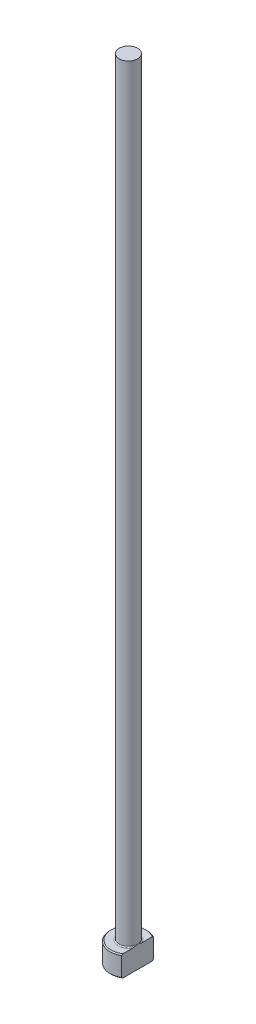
from build123d import *
from build123d.topology import SkipClean

# Parameters (mm, degrees)
CHAMFER1_SIZE    = 0.2
FILLET1_R        = 0.2
KEYED_HEAD_DEPTH = 151.081644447


with BuildPart() as part:
    # Sketch1 → Revolve1 (revolve)
    with BuildSketch(Plane.XY, mode=Mode.PRIVATE) as revolve1_sk:
        Polygon((0, 0), (-3.5, 0), (-3.5, 4), (-1.75, 4), (-1.75, 150), (0, 150), align=None)
    revolve(revolve1_sk.sketch.rotate(Axis((0, 259.958771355, 0), (0, -1, 0)), 270), axis=Axis((0, 259.958771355, 0), (0, -1, 0)))

    # Chamfer1
    chamfer1_edges = [part.edges().sort_by_distance(p)[0] for p in [
        (0, 4, -3.5),
        (0, 0, -3.5),
    ]]
    chamfer(chamfer1_edges, length=CHAMFER1_SIZE)

    # Fillet1
    fillet1_edges = [part.edges().sort_by_distance(p)[0] for p in [
        (0, 4, -1.75),
    ]]
    fillet(fillet1_edges, radius=FILLET1_R)

    # Sketch2 → KEYED HEAD (cut, through all)
    with SkipClean():  # the faces are left unmerged after this step: merging them gives an invalid solid
        with BuildSketch(Plane(origin=(0, 0, 0), x_dir=(1, 0, 0), z_dir=(0, 1, 0))):
            with BuildLine():
                Line((1.75, -3.031088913), (1.75, 3.031088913))
                ThreePointArc((1.75, 3.031088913), (3.5, 0), (1.75, -3.031088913))
            make_face()
        extrude(amount=KEYED_HEAD_DEPTH, mode=Mode.SUBTRACT)


solid = part.part
